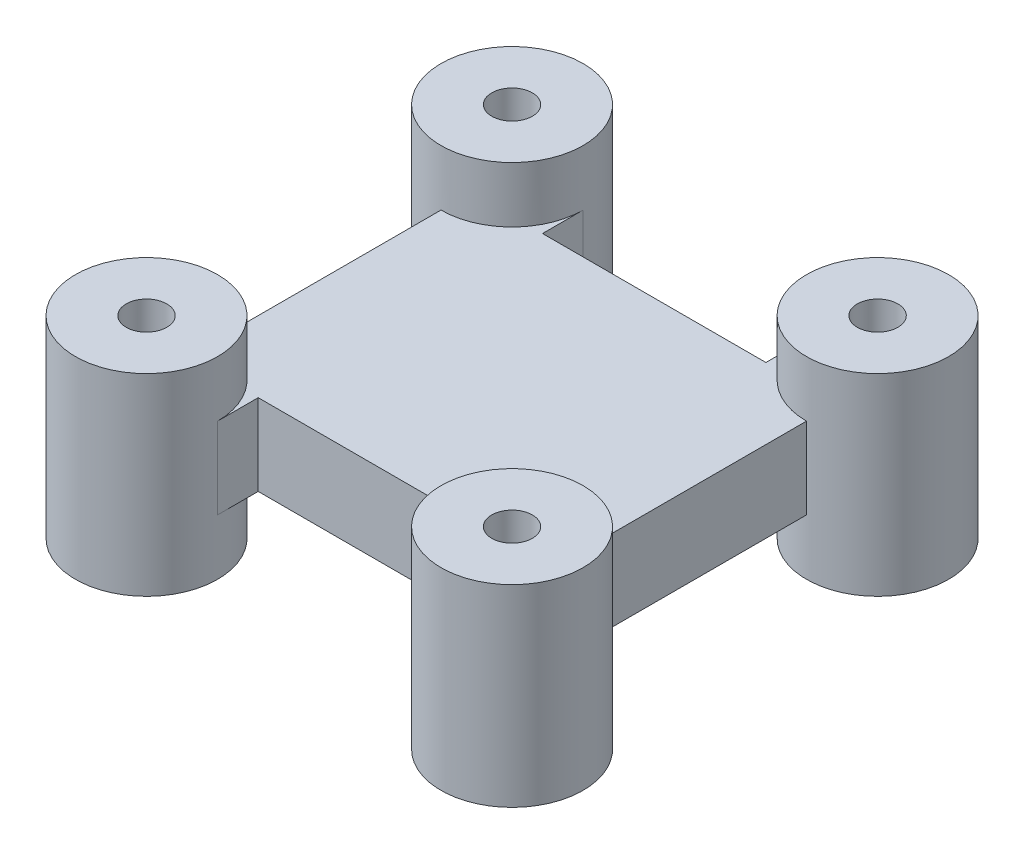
ISO-10303-21;
HEADER;
FILE_DESCRIPTION(('STEP AP214'),'2;1');
FILE_NAME('part.step','',(''),(''),'','','');
FILE_SCHEMA(('AUTOMOTIVE_DESIGN { 1 0 10303 214 1 1 1 1 }'));
ENDSEC;
DATA;
#1=APPLICATION_CONTEXT('core data for automotive mechanical design processes');
#2=APPLICATION_PROTOCOL_DEFINITION('international standard','automotive_design',2000,#1);
#3=PRODUCT_CONTEXT('',#1,'mechanical');
#4=PRODUCT('Part','Part','',(#3));
#5=PRODUCT_RELATED_PRODUCT_CATEGORY('part','',(#4));
#6=PRODUCT_DEFINITION_FORMATION('','',#4);
#7=PRODUCT_DEFINITION_CONTEXT('part definition',#1,'design');
#8=PRODUCT_DEFINITION('design','',#6,#7);
#9=PRODUCT_DEFINITION_SHAPE('','',#8);
#10=(LENGTH_UNIT() NAMED_UNIT(*) SI_UNIT(.MILLI.,.METRE.));
#11=(NAMED_UNIT(*) PLANE_ANGLE_UNIT() SI_UNIT($,.RADIAN.));
#12=(NAMED_UNIT(*) SI_UNIT($,.STERADIAN.) SOLID_ANGLE_UNIT());
#13=UNCERTAINTY_MEASURE_WITH_UNIT(LENGTH_MEASURE(1.E-05),#10,'distance_accuracy_value','');
#14=(GEOMETRIC_REPRESENTATION_CONTEXT(3) GLOBAL_UNCERTAINTY_ASSIGNED_CONTEXT((#13)) GLOBAL_UNIT_ASSIGNED_CONTEXT((#10,
#11,#12)) REPRESENTATION_CONTEXT('',''));
#15=CARTESIAN_POINT('',(0.,0.,0.));
#16=DIRECTION('',(0.,0.,1.));
#17=DIRECTION('',(1.,0.,0.));
#18=AXIS2_PLACEMENT_3D('',#15,#16,#17);
#19=CARTESIAN_POINT('',(0.,8.,0.));
#20=DIRECTION('',(0.,1.,0.));
#21=DIRECTION('',(0.,0.,1.));
#22=AXIS2_PLACEMENT_3D('',#19,#20,#21);
#23=PLANE('',#22);
#24=DIRECTION('',(0.,0.,1.));
#25=VECTOR('',#24,1.);
#26=CARTESIAN_POINT('',(-11.,8.,0.));
#27=LINE('',#26,#25);
#28=CARTESIAN_POINT('',(-11.,8.,-18.));
#29=VERTEX_POINT('',#28);
#30=CARTESIAN_POINT('',(-11.,8.,-14.));
#31=VERTEX_POINT('',#30);
#32=EDGE_CURVE('E146',#29,#31,#27,.T.);
#33=ORIENTED_EDGE('',*,*,#32,.F.);
#34=CARTESIAN_POINT('',(-18.,8.,-18.));
#35=DIRECTION('',(0.,-1.,0.));
#36=DIRECTION('',(0.,0.,-1.));
#37=AXIS2_PLACEMENT_3D('',#34,#35,#36);
#38=CIRCLE('',#37,7.);
#39=CARTESIAN_POINT('',(-18.,8.,-11.));
#40=VERTEX_POINT('',#39);
#41=EDGE_CURVE('E265',#29,#40,#38,.T.);
#42=ORIENTED_EDGE('',*,*,#41,.T.);
#43=DIRECTION('',(0.,0.,1.));
#44=VECTOR('',#43,1.);
#45=CARTESIAN_POINT('',(-18.,8.,0.));
#46=LINE('',#45,#44);
#47=CARTESIAN_POINT('',(-18.,8.,11.));
#48=VERTEX_POINT('',#47);
#49=EDGE_CURVE('E109',#40,#48,#46,.T.);
#50=ORIENTED_EDGE('',*,*,#49,.T.);
#51=CARTESIAN_POINT('',(-18.,8.,18.));
#52=DIRECTION('',(0.,-1.,0.));
#53=DIRECTION('',(0.,0.,-1.));
#54=AXIS2_PLACEMENT_3D('',#51,#52,#53);
#55=CIRCLE('',#54,7.);
#56=CARTESIAN_POINT('',(-11.,8.,18.));
#57=VERTEX_POINT('',#56);
#58=EDGE_CURVE('E204',#48,#57,#55,.T.);
#59=ORIENTED_EDGE('',*,*,#58,.T.);
#60=CARTESIAN_POINT('',(-11.,8.,14.));
#61=VERTEX_POINT('',#60);
#62=EDGE_CURVE('E149',#61,#57,#27,.T.);
#63=ORIENTED_EDGE('',*,*,#62,.F.);
#64=DIRECTION('',(1.,0.,0.));
#65=VECTOR('',#64,1.);
#66=CARTESIAN_POINT('',(0.,8.,14.));
#67=LINE('',#66,#65);
#68=CARTESIAN_POINT('',(11.,8.,14.));
#69=VERTEX_POINT('',#68);
#70=EDGE_CURVE('E238',#61,#69,#67,.T.);
#71=ORIENTED_EDGE('',*,*,#70,.T.);
#72=DIRECTION('',(0.,0.,1.));
#73=VECTOR('',#72,1.);
#74=CARTESIAN_POINT('',(11.,8.,0.));
#75=LINE('',#74,#73);
#76=CARTESIAN_POINT('',(11.,8.,18.));
#77=VERTEX_POINT('',#76);
#78=EDGE_CURVE('E138',#69,#77,#75,.T.);
#79=ORIENTED_EDGE('',*,*,#78,.T.);
#80=CARTESIAN_POINT('',(18.,8.,18.));
#81=DIRECTION('',(0.,-1.,0.));
#82=DIRECTION('',(0.,0.,-1.));
#83=AXIS2_PLACEMENT_3D('',#80,#81,#82);
#84=CIRCLE('',#83,7.);
#85=CARTESIAN_POINT('',(18.,8.,11.));
#86=VERTEX_POINT('',#85);
#87=EDGE_CURVE('E11',#77,#86,#84,.T.);
#88=ORIENTED_EDGE('',*,*,#87,.T.);
#89=DIRECTION('',(0.,0.,1.));
#90=VECTOR('',#89,1.);
#91=CARTESIAN_POINT('',(18.,8.,0.));
#92=LINE('',#91,#90);
#93=CARTESIAN_POINT('',(18.,8.,-11.));
#94=VERTEX_POINT('',#93);
#95=EDGE_CURVE('E136',#94,#86,#92,.T.);
#96=ORIENTED_EDGE('',*,*,#95,.F.);
#97=CARTESIAN_POINT('',(18.,8.,-18.));
#98=DIRECTION('',(0.,-1.,0.));
#99=DIRECTION('',(0.,0.,-1.));
#100=AXIS2_PLACEMENT_3D('',#97,#98,#99);
#101=CIRCLE('',#100,7.);
#102=CARTESIAN_POINT('',(11.,8.,-18.));
#103=VERTEX_POINT('',#102);
#104=EDGE_CURVE('E132',#94,#103,#101,.T.);
#105=ORIENTED_EDGE('',*,*,#104,.T.);
#106=CARTESIAN_POINT('',(11.,8.,-14.));
#107=VERTEX_POINT('',#106);
#108=EDGE_CURVE('E127',#103,#107,#75,.T.);
#109=ORIENTED_EDGE('',*,*,#108,.T.);
#110=DIRECTION('',(1.,0.,0.));
#111=VECTOR('',#110,1.);
#112=CARTESIAN_POINT('',(0.,8.,-14.));
#113=LINE('',#112,#111);
#114=EDGE_CURVE('E128',#31,#107,#113,.T.);
#115=ORIENTED_EDGE('',*,*,#114,.F.);
#116=EDGE_LOOP('',(#33,#42,#50,#59,#63,#71,#79,#88,#96,#105,#109,#115));
#117=FACE_BOUND('',#116,.T.);
#118=ADVANCED_FACE('F47',(#117),#23,.T.);
#119=CARTESIAN_POINT('',(0.,0.,0.));
#120=DIRECTION('',(0.,1.,0.));
#121=DIRECTION('',(0.,0.,1.));
#122=AXIS2_PLACEMENT_3D('',#119,#120,#121);
#123=PLANE('',#122);
#124=CARTESIAN_POINT('',(-18.,0.,-18.));
#125=DIRECTION('',(0.,-1.,0.));
#126=DIRECTION('',(0.,0.,-1.));
#127=AXIS2_PLACEMENT_3D('',#124,#125,#126);
#128=CIRCLE('',#127,7.);
#129=CARTESIAN_POINT('',(-11.,0.,-18.));
#130=VERTEX_POINT('',#129);
#131=CARTESIAN_POINT('',(-18.,0.,-11.));
#132=VERTEX_POINT('',#131);
#133=EDGE_CURVE('E222',#130,#132,#128,.T.);
#134=ORIENTED_EDGE('',*,*,#133,.F.);
#135=DIRECTION('',(0.,0.,1.));
#136=VECTOR('',#135,1.);
#137=CARTESIAN_POINT('',(-11.,0.,0.));
#138=LINE('',#137,#136);
#139=CARTESIAN_POINT('',(-11.,0.,-14.));
#140=VERTEX_POINT('',#139);
#141=EDGE_CURVE('E160',#130,#140,#138,.T.);
#142=ORIENTED_EDGE('',*,*,#141,.T.);
#143=DIRECTION('',(1.,0.,0.));
#144=VECTOR('',#143,1.);
#145=CARTESIAN_POINT('',(0.,0.,-14.));
#146=LINE('',#145,#144);
#147=CARTESIAN_POINT('',(11.,0.,-14.));
#148=VERTEX_POINT('',#147);
#149=EDGE_CURVE('E168',#140,#148,#146,.T.);
#150=ORIENTED_EDGE('',*,*,#149,.T.);
#151=DIRECTION('',(0.,0.,1.));
#152=VECTOR('',#151,1.);
#153=CARTESIAN_POINT('',(11.,0.,0.));
#154=LINE('',#153,#152);
#155=CARTESIAN_POINT('',(11.,0.,-18.));
#156=VERTEX_POINT('',#155);
#157=EDGE_CURVE('E141',#156,#148,#154,.T.);
#158=ORIENTED_EDGE('',*,*,#157,.F.);
#159=CARTESIAN_POINT('',(18.,0.,-18.));
#160=DIRECTION('',(0.,-1.,0.));
#161=DIRECTION('',(0.,0.,-1.));
#162=AXIS2_PLACEMENT_3D('',#159,#160,#161);
#163=CIRCLE('',#162,7.);
#164=CARTESIAN_POINT('',(18.,0.,-11.));
#165=VERTEX_POINT('',#164);
#166=EDGE_CURVE('E214',#165,#156,#163,.T.);
#167=ORIENTED_EDGE('',*,*,#166,.F.);
#168=DIRECTION('',(0.,0.,1.));
#169=VECTOR('',#168,1.);
#170=CARTESIAN_POINT('',(18.,0.,0.));
#171=LINE('',#170,#169);
#172=CARTESIAN_POINT('',(18.,0.,11.));
#173=VERTEX_POINT('',#172);
#174=EDGE_CURVE('E165',#165,#173,#171,.T.);
#175=ORIENTED_EDGE('',*,*,#174,.T.);
#176=CARTESIAN_POINT('',(18.,0.,18.));
#177=DIRECTION('',(0.,-1.,0.));
#178=DIRECTION('',(0.,0.,-1.));
#179=AXIS2_PLACEMENT_3D('',#176,#177,#178);
#180=CIRCLE('',#179,7.);
#181=CARTESIAN_POINT('',(11.,0.,18.));
#182=VERTEX_POINT('',#181);
#183=EDGE_CURVE('E57',#182,#173,#180,.T.);
#184=ORIENTED_EDGE('',*,*,#183,.F.);
#185=CARTESIAN_POINT('',(11.,0.,14.));
#186=VERTEX_POINT('',#185);
#187=EDGE_CURVE('E162',#186,#182,#154,.T.);
#188=ORIENTED_EDGE('',*,*,#187,.F.);
#189=DIRECTION('',(1.,0.,0.));
#190=VECTOR('',#189,1.);
#191=CARTESIAN_POINT('',(0.,0.,14.));
#192=LINE('',#191,#190);
#193=CARTESIAN_POINT('',(-11.,0.,14.));
#194=VERTEX_POINT('',#193);
#195=EDGE_CURVE('E159',#194,#186,#192,.T.);
#196=ORIENTED_EDGE('',*,*,#195,.F.);
#197=CARTESIAN_POINT('',(-11.,0.,18.));
#198=VERTEX_POINT('',#197);
#199=EDGE_CURVE('E155',#194,#198,#138,.T.);
#200=ORIENTED_EDGE('',*,*,#199,.T.);
#201=CARTESIAN_POINT('',(-18.,0.,18.));
#202=DIRECTION('',(0.,-1.,0.));
#203=DIRECTION('',(0.,0.,-1.));
#204=AXIS2_PLACEMENT_3D('',#201,#202,#203);
#205=CIRCLE('',#204,7.);
#206=CARTESIAN_POINT('',(-18.,0.,11.));
#207=VERTEX_POINT('',#206);
#208=EDGE_CURVE('E232',#207,#198,#205,.T.);
#209=ORIENTED_EDGE('',*,*,#208,.F.);
#210=DIRECTION('',(0.,0.,1.));
#211=VECTOR('',#210,1.);
#212=CARTESIAN_POINT('',(-18.,0.,0.));
#213=LINE('',#212,#211);
#214=EDGE_CURVE('E152',#132,#207,#213,.T.);
#215=ORIENTED_EDGE('',*,*,#214,.F.);
#216=EDGE_LOOP('',(#134,#142,#150,#158,#167,#175,#184,#188,#196,#200,#209,#215));
#217=FACE_BOUND('',#216,.T.);
#218=ADVANCED_FACE('F288',(#217),#123,.F.);
#219=CARTESIAN_POINT('',(-18.,8.,-18.));
#220=DIRECTION('',(0.,-1.,0.));
#221=DIRECTION('',(0.,0.,-1.));
#222=AXIS2_PLACEMENT_3D('',#219,#220,#221);
#223=CYLINDRICAL_SURFACE('',#222,7.);
#224=DIRECTION('',(0.,-1.,0.));
#225=VECTOR('',#224,1.);
#226=CARTESIAN_POINT('',(-11.,8.,-18.));
#227=LINE('',#226,#225);
#228=EDGE_CURVE('E66',#29,#130,#227,.T.);
#229=ORIENTED_EDGE('',*,*,#228,.T.);
#230=ORIENTED_EDGE('',*,*,#133,.T.);
#231=DIRECTION('',(0.,-1.,0.));
#232=VECTOR('',#231,1.);
#233=CARTESIAN_POINT('',(-18.,8.,-11.));
#234=LINE('',#233,#232);
#235=EDGE_CURVE('E51',#40,#132,#234,.T.);
#236=ORIENTED_EDGE('',*,*,#235,.F.);
#237=ORIENTED_EDGE('',*,*,#41,.F.);
#238=EDGE_LOOP('',(#229,#230,#236,#237));
#239=FACE_BOUND('',#238,.T.);
#240=CARTESIAN_POINT('',(-18.,-5.5,-18.));
#241=DIRECTION('',(0.,-1.,0.));
#242=DIRECTION('',(0.,0.,-1.));
#243=AXIS2_PLACEMENT_3D('',#240,#241,#242);
#244=CIRCLE('',#243,7.);
#245=CARTESIAN_POINT('',(-18.,-5.5,-25.));
#246=VERTEX_POINT('',#245);
#247=EDGE_CURVE('E224',#246,#246,#244,.T.);
#248=ORIENTED_EDGE('',*,*,#247,.F.);
#249=EDGE_LOOP('',(#248));
#250=FACE_BOUND('',#249,.T.);
#251=CARTESIAN_POINT('',(-18.,13.5,-18.));
#252=DIRECTION('',(0.,-1.,0.));
#253=DIRECTION('',(0.,0.,-1.));
#254=AXIS2_PLACEMENT_3D('',#251,#252,#253);
#255=CIRCLE('',#254,7.);
#256=CARTESIAN_POINT('',(-18.,13.5,-25.));
#257=VERTEX_POINT('',#256);
#258=EDGE_CURVE('E259',#257,#257,#255,.T.);
#259=ORIENTED_EDGE('',*,*,#258,.T.);
#260=EDGE_LOOP('',(#259));
#261=FACE_BOUND('',#260,.T.);
#262=ADVANCED_FACE('F49',(#239,#250,#261),#223,.T.);
#263=CARTESIAN_POINT('',(-18.,8.,0.));
#264=DIRECTION('',(1.,0.,0.));
#265=DIRECTION('',(0.,0.,-1.));
#266=AXIS2_PLACEMENT_3D('',#263,#264,#265);
#267=PLANE('',#266);
#268=ORIENTED_EDGE('',*,*,#214,.T.);
#269=DIRECTION('',(0.,-1.,0.));
#270=VECTOR('',#269,1.);
#271=CARTESIAN_POINT('',(-18.,8.,11.));
#272=LINE('',#271,#270);
#273=EDGE_CURVE('E189',#48,#207,#272,.T.);
#274=ORIENTED_EDGE('',*,*,#273,.F.);
#275=ORIENTED_EDGE('',*,*,#49,.F.);
#276=ORIENTED_EDGE('',*,*,#235,.T.);
#277=EDGE_LOOP('',(#268,#274,#275,#276));
#278=FACE_BOUND('',#277,.T.);
#279=ADVANCED_FACE('F352',(#278),#267,.F.);
#280=CARTESIAN_POINT('',(-18.,8.,18.));
#281=DIRECTION('',(0.,-1.,0.));
#282=DIRECTION('',(0.,0.,-1.));
#283=AXIS2_PLACEMENT_3D('',#280,#281,#282);
#284=CYLINDRICAL_SURFACE('',#283,7.);
#285=ORIENTED_EDGE('',*,*,#273,.T.);
#286=ORIENTED_EDGE('',*,*,#208,.T.);
#287=DIRECTION('',(0.,-1.,0.));
#288=VECTOR('',#287,1.);
#289=CARTESIAN_POINT('',(-11.,8.,18.));
#290=LINE('',#289,#288);
#291=EDGE_CURVE('E187',#57,#198,#290,.T.);
#292=ORIENTED_EDGE('',*,*,#291,.F.);
#293=ORIENTED_EDGE('',*,*,#58,.F.);
#294=EDGE_LOOP('',(#285,#286,#292,#293));
#295=FACE_BOUND('',#294,.T.);
#296=CARTESIAN_POINT('',(-18.,-5.5,18.));
#297=DIRECTION('',(0.,-1.,0.));
#298=DIRECTION('',(0.,0.,-1.));
#299=AXIS2_PLACEMENT_3D('',#296,#297,#298);
#300=CIRCLE('',#299,7.);
#301=CARTESIAN_POINT('',(-18.,-5.5,11.));
#302=VERTEX_POINT('',#301);
#303=EDGE_CURVE('E156',#302,#302,#300,.T.);
#304=ORIENTED_EDGE('',*,*,#303,.F.);
#305=EDGE_LOOP('',(#304));
#306=FACE_BOUND('',#305,.T.);
#307=CARTESIAN_POINT('',(-18.,13.5,18.));
#308=DIRECTION('',(0.,-1.,0.));
#309=DIRECTION('',(0.,0.,-1.));
#310=AXIS2_PLACEMENT_3D('',#307,#308,#309);
#311=CIRCLE('',#310,7.);
#312=CARTESIAN_POINT('',(-18.,13.5,11.));
#313=VERTEX_POINT('',#312);
#314=EDGE_CURVE('E227',#313,#313,#311,.T.);
#315=ORIENTED_EDGE('',*,*,#314,.T.);
#316=EDGE_LOOP('',(#315));
#317=FACE_BOUND('',#316,.T.);
#318=ADVANCED_FACE('F279',(#295,#306,#317),#284,.T.);
#319=CARTESIAN_POINT('',(-11.,8.,0.));
#320=DIRECTION('',(1.,0.,0.));
#321=DIRECTION('',(0.,0.,-1.));
#322=AXIS2_PLACEMENT_3D('',#319,#320,#321);
#323=PLANE('',#322);
#324=ORIENTED_EDGE('',*,*,#199,.F.);
#325=DIRECTION('',(0.,-1.,0.));
#326=VECTOR('',#325,1.);
#327=CARTESIAN_POINT('',(-11.,8.,14.));
#328=LINE('',#327,#326);
#329=EDGE_CURVE('E185',#61,#194,#328,.T.);
#330=ORIENTED_EDGE('',*,*,#329,.F.);
#331=ORIENTED_EDGE('',*,*,#62,.T.);
#332=ORIENTED_EDGE('',*,*,#291,.T.);
#333=EDGE_LOOP('',(#324,#330,#331,#332));
#334=FACE_BOUND('',#333,.T.);
#335=ADVANCED_FACE('F284',(#334),#323,.T.);
#336=CARTESIAN_POINT('',(0.,8.,14.));
#337=DIRECTION('',(0.,0.,-1.));
#338=DIRECTION('',(-1.,0.,0.));
#339=AXIS2_PLACEMENT_3D('',#336,#337,#338);
#340=PLANE('',#339);
#341=ORIENTED_EDGE('',*,*,#195,.T.);
#342=DIRECTION('',(0.,-1.,0.));
#343=VECTOR('',#342,1.);
#344=CARTESIAN_POINT('',(11.,8.,14.));
#345=LINE('',#344,#343);
#346=EDGE_CURVE('E182',#69,#186,#345,.T.);
#347=ORIENTED_EDGE('',*,*,#346,.F.);
#348=ORIENTED_EDGE('',*,*,#70,.F.);
#349=ORIENTED_EDGE('',*,*,#329,.T.);
#350=EDGE_LOOP('',(#341,#347,#348,#349));
#351=FACE_BOUND('',#350,.T.);
#352=ADVANCED_FACE('F293',(#351),#340,.F.);
#353=CARTESIAN_POINT('',(11.,8.,0.));
#354=DIRECTION('',(1.,0.,0.));
#355=DIRECTION('',(0.,0.,-1.));
#356=AXIS2_PLACEMENT_3D('',#353,#354,#355);
#357=PLANE('',#356);
#358=ORIENTED_EDGE('',*,*,#187,.T.);
#359=DIRECTION('',(0.,-1.,0.));
#360=VECTOR('',#359,1.);
#361=CARTESIAN_POINT('',(11.,8.,18.));
#362=LINE('',#361,#360);
#363=EDGE_CURVE('E179',#77,#182,#362,.T.);
#364=ORIENTED_EDGE('',*,*,#363,.F.);
#365=ORIENTED_EDGE('',*,*,#78,.F.);
#366=ORIENTED_EDGE('',*,*,#346,.T.);
#367=EDGE_LOOP('',(#358,#364,#365,#366));
#368=FACE_BOUND('',#367,.T.);
#369=ADVANCED_FACE('F296',(#368),#357,.F.);
#370=CARTESIAN_POINT('',(18.,8.,18.));
#371=DIRECTION('',(0.,-1.,0.));
#372=DIRECTION('',(0.,0.,-1.));
#373=AXIS2_PLACEMENT_3D('',#370,#371,#372);
#374=CYLINDRICAL_SURFACE('',#373,7.);
#375=ORIENTED_EDGE('',*,*,#363,.T.);
#376=ORIENTED_EDGE('',*,*,#183,.T.);
#377=DIRECTION('',(0.,-1.,0.));
#378=VECTOR('',#377,1.);
#379=CARTESIAN_POINT('',(18.,8.,11.));
#380=LINE('',#379,#378);
#381=EDGE_CURVE('E176',#86,#173,#380,.T.);
#382=ORIENTED_EDGE('',*,*,#381,.F.);
#383=ORIENTED_EDGE('',*,*,#87,.F.);
#384=EDGE_LOOP('',(#375,#376,#382,#383));
#385=FACE_BOUND('',#384,.T.);
#386=CARTESIAN_POINT('',(18.,-5.5,18.));
#387=DIRECTION('',(0.,-1.,0.));
#388=DIRECTION('',(0.,0.,-1.));
#389=AXIS2_PLACEMENT_3D('',#386,#387,#388);
#390=CIRCLE('',#389,7.);
#391=CARTESIAN_POINT('',(18.,-5.5,11.));
#392=VERTEX_POINT('',#391);
#393=EDGE_CURVE('E206',#392,#392,#390,.T.);
#394=ORIENTED_EDGE('',*,*,#393,.F.);
#395=EDGE_LOOP('',(#394));
#396=FACE_BOUND('',#395,.T.);
#397=CARTESIAN_POINT('',(18.,13.5,18.));
#398=DIRECTION('',(0.,-1.,0.));
#399=DIRECTION('',(0.,0.,-1.));
#400=AXIS2_PLACEMENT_3D('',#397,#398,#399);
#401=CIRCLE('',#400,7.);
#402=CARTESIAN_POINT('',(18.,13.5,11.));
#403=VERTEX_POINT('',#402);
#404=EDGE_CURVE('E271',#403,#403,#401,.T.);
#405=ORIENTED_EDGE('',*,*,#404,.T.);
#406=EDGE_LOOP('',(#405));
#407=FACE_BOUND('',#406,.T.);
#408=ADVANCED_FACE('F298',(#385,#396,#407),#374,.T.);
#409=CARTESIAN_POINT('',(18.,8.,0.));
#410=DIRECTION('',(1.,0.,0.));
#411=DIRECTION('',(0.,0.,-1.));
#412=AXIS2_PLACEMENT_3D('',#409,#410,#411);
#413=PLANE('',#412);
#414=ORIENTED_EDGE('',*,*,#174,.F.);
#415=DIRECTION('',(0.,-1.,0.));
#416=VECTOR('',#415,1.);
#417=CARTESIAN_POINT('',(18.,8.,-11.));
#418=LINE('',#417,#416);
#419=EDGE_CURVE('E173',#94,#165,#418,.T.);
#420=ORIENTED_EDGE('',*,*,#419,.F.);
#421=ORIENTED_EDGE('',*,*,#95,.T.);
#422=ORIENTED_EDGE('',*,*,#381,.T.);
#423=EDGE_LOOP('',(#414,#420,#421,#422));
#424=FACE_BOUND('',#423,.T.);
#425=ADVANCED_FACE('F246',(#424),#413,.T.);
#426=CARTESIAN_POINT('',(18.,8.,-18.));
#427=DIRECTION('',(0.,-1.,0.));
#428=DIRECTION('',(0.,0.,-1.));
#429=AXIS2_PLACEMENT_3D('',#426,#427,#428);
#430=CYLINDRICAL_SURFACE('',#429,7.);
#431=ORIENTED_EDGE('',*,*,#419,.T.);
#432=ORIENTED_EDGE('',*,*,#166,.T.);
#433=DIRECTION('',(0.,-1.,0.));
#434=VECTOR('',#433,1.);
#435=CARTESIAN_POINT('',(11.,8.,-18.));
#436=LINE('',#435,#434);
#437=EDGE_CURVE('E143',#103,#156,#436,.T.);
#438=ORIENTED_EDGE('',*,*,#437,.F.);
#439=ORIENTED_EDGE('',*,*,#104,.F.);
#440=EDGE_LOOP('',(#431,#432,#438,#439));
#441=FACE_BOUND('',#440,.T.);
#442=CARTESIAN_POINT('',(18.,-5.5,-18.));
#443=DIRECTION('',(0.,-1.,0.));
#444=DIRECTION('',(0.,0.,-1.));
#445=AXIS2_PLACEMENT_3D('',#442,#443,#444);
#446=CIRCLE('',#445,7.);
#447=CARTESIAN_POINT('',(18.,-5.5,-25.));
#448=VERTEX_POINT('',#447);
#449=EDGE_CURVE('E216',#448,#448,#446,.T.);
#450=ORIENTED_EDGE('',*,*,#449,.F.);
#451=EDGE_LOOP('',(#450));
#452=FACE_BOUND('',#451,.T.);
#453=CARTESIAN_POINT('',(18.,13.5,-18.));
#454=DIRECTION('',(0.,-1.,0.));
#455=DIRECTION('',(0.,0.,-1.));
#456=AXIS2_PLACEMENT_3D('',#453,#454,#455);
#457=CIRCLE('',#456,7.);
#458=CARTESIAN_POINT('',(18.,13.5,-25.));
#459=VERTEX_POINT('',#458);
#460=EDGE_CURVE('E252',#459,#459,#457,.T.);
#461=ORIENTED_EDGE('',*,*,#460,.T.);
#462=EDGE_LOOP('',(#461));
#463=FACE_BOUND('',#462,.T.);
#464=ADVANCED_FACE('F249',(#441,#452,#463),#430,.T.);
#465=ORIENTED_EDGE('',*,*,#157,.T.);
#466=DIRECTION('',(0.,-1.,0.));
#467=VECTOR('',#466,1.);
#468=CARTESIAN_POINT('',(11.,8.,-14.));
#469=LINE('',#468,#467);
#470=EDGE_CURVE('E97',#107,#148,#469,.T.);
#471=ORIENTED_EDGE('',*,*,#470,.F.);
#472=ORIENTED_EDGE('',*,*,#108,.F.);
#473=ORIENTED_EDGE('',*,*,#437,.T.);
#474=EDGE_LOOP('',(#465,#471,#472,#473));
#475=FACE_BOUND('',#474,.T.);
#476=ADVANCED_FACE('F139',(#475),#357,.F.);
#477=CARTESIAN_POINT('',(0.,8.,-14.));
#478=DIRECTION('',(0.,0.,-1.));
#479=DIRECTION('',(-1.,0.,0.));
#480=AXIS2_PLACEMENT_3D('',#477,#478,#479);
#481=PLANE('',#480);
#482=ORIENTED_EDGE('',*,*,#149,.F.);
#483=DIRECTION('',(0.,-1.,0.));
#484=VECTOR('',#483,1.);
#485=CARTESIAN_POINT('',(-11.,8.,-14.));
#486=LINE('',#485,#484);
#487=EDGE_CURVE('E101',#31,#140,#486,.T.);
#488=ORIENTED_EDGE('',*,*,#487,.F.);
#489=ORIENTED_EDGE('',*,*,#114,.T.);
#490=ORIENTED_EDGE('',*,*,#470,.T.);
#491=EDGE_LOOP('',(#482,#488,#489,#490));
#492=FACE_BOUND('',#491,.T.);
#493=ADVANCED_FACE('F145',(#492),#481,.T.);
#494=ORIENTED_EDGE('',*,*,#141,.F.);
#495=ORIENTED_EDGE('',*,*,#228,.F.);
#496=ORIENTED_EDGE('',*,*,#32,.T.);
#497=ORIENTED_EDGE('',*,*,#487,.T.);
#498=EDGE_LOOP('',(#494,#495,#496,#497));
#499=FACE_BOUND('',#498,.T.);
#500=ADVANCED_FACE('F338',(#499),#323,.T.);
#501=CARTESIAN_POINT('',(-18.,0.,-18.));
#502=DIRECTION('',(0.,1.,0.));
#503=DIRECTION('',(0.,0.,1.));
#504=AXIS2_PLACEMENT_3D('',#501,#502,#503);
#505=CYLINDRICAL_SURFACE('',#504,2.00000000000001);
#506=CARTESIAN_POINT('',(-18.,-5.5,-18.));
#507=DIRECTION('',(0.,-1.,0.));
#508=DIRECTION('',(0.,0.,-1.));
#509=AXIS2_PLACEMENT_3D('',#506,#507,#508);
#510=CIRCLE('',#509,2.00000000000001);
#511=CARTESIAN_POINT('',(-18.,-5.5,-20.));
#512=VERTEX_POINT('',#511);
#513=EDGE_CURVE('E219',#512,#512,#510,.T.);
#514=ORIENTED_EDGE('',*,*,#513,.T.);
#515=EDGE_LOOP('',(#514));
#516=FACE_BOUND('',#515,.T.);
#517=CARTESIAN_POINT('',(-18.,13.5,-18.));
#518=DIRECTION('',(0.,-1.,0.));
#519=DIRECTION('',(0.,0.,-1.));
#520=AXIS2_PLACEMENT_3D('',#517,#518,#519);
#521=CIRCLE('',#520,2.00000000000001);
#522=CARTESIAN_POINT('',(-18.,13.5,-20.));
#523=VERTEX_POINT('',#522);
#524=EDGE_CURVE('E262',#523,#523,#521,.T.);
#525=ORIENTED_EDGE('',*,*,#524,.F.);
#526=EDGE_LOOP('',(#525));
#527=FACE_BOUND('',#526,.T.);
#528=ADVANCED_FACE('F327',(#516,#527),#505,.F.);
#529=CARTESIAN_POINT('',(-18.,0.,18.));
#530=DIRECTION('',(0.,1.,0.));
#531=DIRECTION('',(0.,0.,1.));
#532=AXIS2_PLACEMENT_3D('',#529,#530,#531);
#533=CYLINDRICAL_SURFACE('',#532,2.);
#534=CARTESIAN_POINT('',(-18.,-5.5,18.));
#535=DIRECTION('',(0.,-1.,0.));
#536=DIRECTION('',(0.,0.,-1.));
#537=AXIS2_PLACEMENT_3D('',#534,#535,#536);
#538=CIRCLE('',#537,2.);
#539=CARTESIAN_POINT('',(-18.,-5.5,16.));
#540=VERTEX_POINT('',#539);
#541=EDGE_CURVE('E213',#540,#540,#538,.T.);
#542=ORIENTED_EDGE('',*,*,#541,.T.);
#543=EDGE_LOOP('',(#542));
#544=FACE_BOUND('',#543,.T.);
#545=CARTESIAN_POINT('',(-18.,13.5,18.));
#546=DIRECTION('',(0.,-1.,0.));
#547=DIRECTION('',(0.,0.,-1.));
#548=AXIS2_PLACEMENT_3D('',#545,#546,#547);
#549=CIRCLE('',#548,2.);
#550=CARTESIAN_POINT('',(-18.,13.5,16.));
#551=VERTEX_POINT('',#550);
#552=EDGE_CURVE('E269',#551,#551,#549,.T.);
#553=ORIENTED_EDGE('',*,*,#552,.F.);
#554=EDGE_LOOP('',(#553));
#555=FACE_BOUND('',#554,.T.);
#556=ADVANCED_FACE('F317',(#544,#555),#533,.F.);
#557=CARTESIAN_POINT('',(18.,0.,18.));
#558=DIRECTION('',(0.,1.,0.));
#559=DIRECTION('',(0.,0.,1.));
#560=AXIS2_PLACEMENT_3D('',#557,#558,#559);
#561=CYLINDRICAL_SURFACE('',#560,2.);
#562=CARTESIAN_POINT('',(18.,-5.5,18.));
#563=DIRECTION('',(0.,-1.,0.));
#564=DIRECTION('',(0.,0.,-1.));
#565=AXIS2_PLACEMENT_3D('',#562,#563,#564);
#566=CIRCLE('',#565,2.);
#567=CARTESIAN_POINT('',(18.,-5.5,16.));
#568=VERTEX_POINT('',#567);
#569=EDGE_CURVE('E209',#568,#568,#566,.T.);
#570=ORIENTED_EDGE('',*,*,#569,.T.);
#571=EDGE_LOOP('',(#570));
#572=FACE_BOUND('',#571,.T.);
#573=CARTESIAN_POINT('',(18.,13.5,18.));
#574=DIRECTION('',(0.,-1.,0.));
#575=DIRECTION('',(0.,0.,-1.));
#576=AXIS2_PLACEMENT_3D('',#573,#574,#575);
#577=CIRCLE('',#576,2.);
#578=CARTESIAN_POINT('',(18.,13.5,16.));
#579=VERTEX_POINT('',#578);
#580=EDGE_CURVE('E256',#579,#579,#577,.T.);
#581=ORIENTED_EDGE('',*,*,#580,.F.);
#582=EDGE_LOOP('',(#581));
#583=FACE_BOUND('',#582,.T.);
#584=ADVANCED_FACE('F314',(#572,#583),#561,.F.);
#585=CARTESIAN_POINT('',(18.,0.,-18.));
#586=DIRECTION('',(0.,1.,0.));
#587=DIRECTION('',(0.,0.,1.));
#588=AXIS2_PLACEMENT_3D('',#585,#586,#587);
#589=CYLINDRICAL_SURFACE('',#588,2.);
#590=CARTESIAN_POINT('',(18.,-5.5,-18.));
#591=DIRECTION('',(0.,-1.,0.));
#592=DIRECTION('',(0.,0.,-1.));
#593=AXIS2_PLACEMENT_3D('',#590,#591,#592);
#594=CIRCLE('',#593,2.);
#595=CARTESIAN_POINT('',(18.,-5.5,-20.));
#596=VERTEX_POINT('',#595);
#597=EDGE_CURVE('E210',#596,#596,#594,.T.);
#598=ORIENTED_EDGE('',*,*,#597,.T.);
#599=EDGE_LOOP('',(#598));
#600=FACE_BOUND('',#599,.T.);
#601=CARTESIAN_POINT('',(18.,13.5,-18.));
#602=DIRECTION('',(0.,-1.,0.));
#603=DIRECTION('',(0.,0.,-1.));
#604=AXIS2_PLACEMENT_3D('',#601,#602,#603);
#605=CIRCLE('',#604,2.);
#606=CARTESIAN_POINT('',(18.,13.5,-20.));
#607=VERTEX_POINT('',#606);
#608=EDGE_CURVE('E253',#607,#607,#605,.T.);
#609=ORIENTED_EDGE('',*,*,#608,.F.);
#610=EDGE_LOOP('',(#609));
#611=FACE_BOUND('',#610,.T.);
#612=ADVANCED_FACE('F316',(#600,#611),#589,.F.);
#613=CARTESIAN_POINT('',(-18.,-5.5,18.));
#614=DIRECTION('',(0.,-1.,0.));
#615=DIRECTION('',(0.,0.,-1.));
#616=AXIS2_PLACEMENT_3D('',#613,#614,#615);
#617=PLANE('',#616);
#618=ORIENTED_EDGE('',*,*,#303,.T.);
#619=EDGE_LOOP('',(#618));
#620=FACE_BOUND('',#619,.T.);
#621=ORIENTED_EDGE('',*,*,#541,.F.);
#622=EDGE_LOOP('',(#621));
#623=FACE_BOUND('',#622,.T.);
#624=ADVANCED_FACE('F324',(#620,#623),#617,.T.);
#625=CARTESIAN_POINT('',(18.,-5.5,18.));
#626=DIRECTION('',(0.,-1.,0.));
#627=DIRECTION('',(0.,0.,-1.));
#628=AXIS2_PLACEMENT_3D('',#625,#626,#627);
#629=PLANE('',#628);
#630=ORIENTED_EDGE('',*,*,#393,.T.);
#631=EDGE_LOOP('',(#630));
#632=FACE_BOUND('',#631,.T.);
#633=ORIENTED_EDGE('',*,*,#569,.F.);
#634=EDGE_LOOP('',(#633));
#635=FACE_BOUND('',#634,.T.);
#636=ADVANCED_FACE('F388',(#632,#635),#629,.T.);
#637=CARTESIAN_POINT('',(18.,-5.5,-18.));
#638=DIRECTION('',(0.,-1.,0.));
#639=DIRECTION('',(0.,0.,-1.));
#640=AXIS2_PLACEMENT_3D('',#637,#638,#639);
#641=PLANE('',#640);
#642=ORIENTED_EDGE('',*,*,#449,.T.);
#643=EDGE_LOOP('',(#642));
#644=FACE_BOUND('',#643,.T.);
#645=ORIENTED_EDGE('',*,*,#597,.F.);
#646=EDGE_LOOP('',(#645));
#647=FACE_BOUND('',#646,.T.);
#648=ADVANCED_FACE('F391',(#644,#647),#641,.T.);
#649=CARTESIAN_POINT('',(-18.,-5.5,-18.));
#650=DIRECTION('',(0.,-1.,0.));
#651=DIRECTION('',(0.,0.,-1.));
#652=AXIS2_PLACEMENT_3D('',#649,#650,#651);
#653=PLANE('',#652);
#654=ORIENTED_EDGE('',*,*,#247,.T.);
#655=EDGE_LOOP('',(#654));
#656=FACE_BOUND('',#655,.T.);
#657=ORIENTED_EDGE('',*,*,#513,.F.);
#658=EDGE_LOOP('',(#657));
#659=FACE_BOUND('',#658,.T.);
#660=ADVANCED_FACE('F386',(#656,#659),#653,.T.);
#661=CARTESIAN_POINT('',(-18.,13.5,18.));
#662=DIRECTION('',(0.,1.,0.));
#663=DIRECTION('',(0.,0.,-1.));
#664=AXIS2_PLACEMENT_3D('',#661,#662,#663);
#665=PLANE('',#664);
#666=ORIENTED_EDGE('',*,*,#552,.T.);
#667=EDGE_LOOP('',(#666));
#668=FACE_BOUND('',#667,.T.);
#669=ORIENTED_EDGE('',*,*,#314,.F.);
#670=EDGE_LOOP('',(#669));
#671=FACE_BOUND('',#670,.T.);
#672=ADVANCED_FACE('F383',(#668,#671),#665,.T.);
#673=CARTESIAN_POINT('',(18.,13.5,18.));
#674=DIRECTION('',(0.,1.,0.));
#675=DIRECTION('',(0.,0.,-1.));
#676=AXIS2_PLACEMENT_3D('',#673,#674,#675);
#677=PLANE('',#676);
#678=ORIENTED_EDGE('',*,*,#580,.T.);
#679=EDGE_LOOP('',(#678));
#680=FACE_BOUND('',#679,.T.);
#681=ORIENTED_EDGE('',*,*,#404,.F.);
#682=EDGE_LOOP('',(#681));
#683=FACE_BOUND('',#682,.T.);
#684=ADVANCED_FACE('F312',(#680,#683),#677,.T.);
#685=CARTESIAN_POINT('',(18.,13.5,-18.));
#686=DIRECTION('',(0.,1.,0.));
#687=DIRECTION('',(0.,0.,-1.));
#688=AXIS2_PLACEMENT_3D('',#685,#686,#687);
#689=PLANE('',#688);
#690=ORIENTED_EDGE('',*,*,#608,.T.);
#691=EDGE_LOOP('',(#690));
#692=FACE_BOUND('',#691,.T.);
#693=ORIENTED_EDGE('',*,*,#460,.F.);
#694=EDGE_LOOP('',(#693));
#695=FACE_BOUND('',#694,.T.);
#696=ADVANCED_FACE('F373',(#692,#695),#689,.T.);
#697=CARTESIAN_POINT('',(-18.,13.5,-18.));
#698=DIRECTION('',(0.,1.,0.));
#699=DIRECTION('',(0.,0.,-1.));
#700=AXIS2_PLACEMENT_3D('',#697,#698,#699);
#701=PLANE('',#700);
#702=ORIENTED_EDGE('',*,*,#524,.T.);
#703=EDGE_LOOP('',(#702));
#704=FACE_BOUND('',#703,.T.);
#705=ORIENTED_EDGE('',*,*,#258,.F.);
#706=EDGE_LOOP('',(#705));
#707=FACE_BOUND('',#706,.T.);
#708=ADVANCED_FACE('F371',(#704,#707),#701,.T.);
#709=CLOSED_SHELL('',(#118,#218,#262,#279,#318,#335,#352,#369,#408,#425,#464,#476,#493,#500,
#528,#556,#584,#612,#624,#636,#648,#660,#672,#684,#696,#708));
#710=MANIFOLD_SOLID_BREP('B2',#709);
#711=ADVANCED_BREP_SHAPE_REPRESENTATION('',(#18,#710),#14);
#712=SHAPE_DEFINITION_REPRESENTATION(#9,#711);
ENDSEC;
END-ISO-10303-21;
